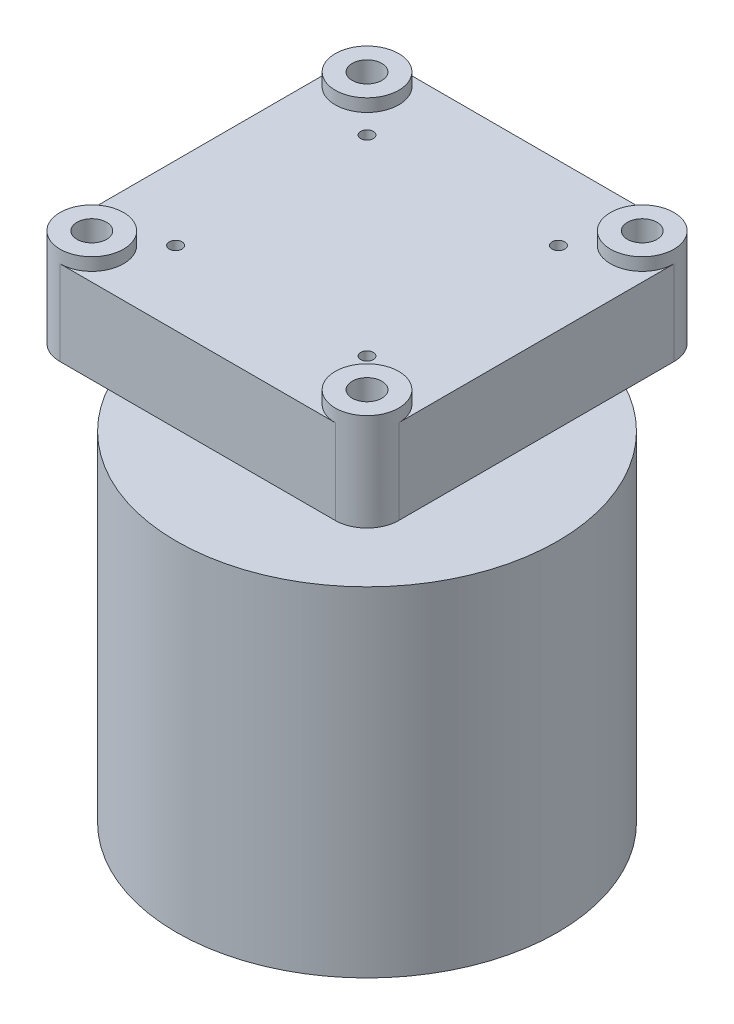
ISO-10303-21;
HEADER;
FILE_DESCRIPTION(('STEP AP214'),'2;1');
FILE_NAME('part.step','',(''),(''),'','','');
FILE_SCHEMA(('AUTOMOTIVE_DESIGN { 1 0 10303 214 1 1 1 1 }'));
ENDSEC;
DATA;
#1=APPLICATION_CONTEXT('core data for automotive mechanical design processes');
#2=APPLICATION_PROTOCOL_DEFINITION('international standard','automotive_design',2000,#1);
#3=PRODUCT_CONTEXT('',#1,'mechanical');
#4=PRODUCT('Part','Part','',(#3));
#5=PRODUCT_RELATED_PRODUCT_CATEGORY('part','',(#4));
#6=PRODUCT_DEFINITION_FORMATION('','',#4);
#7=PRODUCT_DEFINITION_CONTEXT('part definition',#1,'design');
#8=PRODUCT_DEFINITION('design','',#6,#7);
#9=PRODUCT_DEFINITION_SHAPE('','',#8);
#10=(LENGTH_UNIT() NAMED_UNIT(*) SI_UNIT(.MILLI.,.METRE.));
#11=(NAMED_UNIT(*) PLANE_ANGLE_UNIT() SI_UNIT($,.RADIAN.));
#12=(NAMED_UNIT(*) SI_UNIT($,.STERADIAN.) SOLID_ANGLE_UNIT());
#13=UNCERTAINTY_MEASURE_WITH_UNIT(LENGTH_MEASURE(1.E-05),#10,'distance_accuracy_value','');
#14=(GEOMETRIC_REPRESENTATION_CONTEXT(3) GLOBAL_UNCERTAINTY_ASSIGNED_CONTEXT((#13)) GLOBAL_UNIT_ASSIGNED_CONTEXT((#10,
#11,#12)) REPRESENTATION_CONTEXT('',''));
#15=CARTESIAN_POINT('',(0.,0.,0.));
#16=DIRECTION('',(0.,0.,1.));
#17=DIRECTION('',(1.,0.,0.));
#18=AXIS2_PLACEMENT_3D('',#15,#16,#17);
#19=CARTESIAN_POINT('',(-32.5,20.,32.5));
#20=DIRECTION('',(0.,-1.,0.));
#21=DIRECTION('',(0.,0.,-1.));
#22=AXIS2_PLACEMENT_3D('',#19,#20,#21);
#23=PLANE('',#22);
#24=CARTESIAN_POINT('',(22.6005050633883,20.,-22.6005050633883));
#25=DIRECTION('',(0.,1.,0.));
#26=DIRECTION('',(0.,0.,-1.));
#27=AXIS2_PLACEMENT_3D('',#24,#25,#26);
#28=CIRCLE('',#27,1.5);
#29=CARTESIAN_POINT('',(22.6005050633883,20.,-24.1005050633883));
#30=VERTEX_POINT('',#29);
#31=EDGE_CURVE('E169',#30,#30,#28,.T.);
#32=ORIENTED_EDGE('',*,*,#31,.F.);
#33=EDGE_LOOP('',(#32));
#34=FACE_BOUND('',#33,.T.);
#35=CARTESIAN_POINT('',(-22.6005050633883,20.,-22.6005050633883));
#36=DIRECTION('',(0.,1.,0.));
#37=DIRECTION('',(0.,0.,1.));
#38=AXIS2_PLACEMENT_3D('',#35,#36,#37);
#39=CIRCLE('',#38,1.5);
#40=CARTESIAN_POINT('',(-22.6005050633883,20.,-21.1005050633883));
#41=VERTEX_POINT('',#40);
#42=EDGE_CURVE('E175',#41,#41,#39,.T.);
#43=ORIENTED_EDGE('',*,*,#42,.F.);
#44=EDGE_LOOP('',(#43));
#45=FACE_BOUND('',#44,.T.);
#46=CARTESIAN_POINT('',(-22.6005050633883,20.,22.6005050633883));
#47=DIRECTION('',(0.,1.,0.));
#48=DIRECTION('',(0.,0.,-1.));
#49=AXIS2_PLACEMENT_3D('',#46,#47,#48);
#50=CIRCLE('',#49,1.5);
#51=CARTESIAN_POINT('',(-22.6005050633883,20.,21.1005050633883));
#52=VERTEX_POINT('',#51);
#53=EDGE_CURVE('E181',#52,#52,#50,.T.);
#54=ORIENTED_EDGE('',*,*,#53,.F.);
#55=EDGE_LOOP('',(#54));
#56=FACE_BOUND('',#55,.T.);
#57=CARTESIAN_POINT('',(22.6005050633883,20.,22.6005050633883));
#58=DIRECTION('',(0.,1.,0.));
#59=DIRECTION('',(0.,0.,1.));
#60=AXIS2_PLACEMENT_3D('',#57,#58,#59);
#61=CIRCLE('',#60,1.5);
#62=CARTESIAN_POINT('',(22.6005050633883,20.,24.1005050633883));
#63=VERTEX_POINT('',#62);
#64=EDGE_CURVE('E187',#63,#63,#61,.T.);
#65=ORIENTED_EDGE('',*,*,#64,.F.);
#66=EDGE_LOOP('',(#65));
#67=FACE_BOUND('',#66,.T.);
#68=CARTESIAN_POINT('',(-32.5,20.,-32.5));
#69=DIRECTION('',(0.,1.,0.));
#70=DIRECTION('',(0.,0.,-1.));
#71=AXIS2_PLACEMENT_3D('',#68,#69,#70);
#72=CIRCLE('',#71,7.5);
#73=CARTESIAN_POINT('',(-40.,20.,-32.5));
#74=VERTEX_POINT('',#73);
#75=CARTESIAN_POINT('',(-32.5,20.,-40.));
#76=VERTEX_POINT('',#75);
#77=EDGE_CURVE('E120',#74,#76,#72,.T.);
#78=ORIENTED_EDGE('',*,*,#77,.F.);
#79=DIRECTION('',(0.,0.,1.));
#80=VECTOR('',#79,1.);
#81=CARTESIAN_POINT('',(-40.,20.,32.5));
#82=LINE('',#81,#80);
#83=CARTESIAN_POINT('',(-40.,20.,32.5));
#84=VERTEX_POINT('',#83);
#85=EDGE_CURVE('E55',#74,#84,#82,.T.);
#86=ORIENTED_EDGE('',*,*,#85,.T.);
#87=CARTESIAN_POINT('',(-32.5,20.,32.5));
#88=DIRECTION('',(0.,1.,0.));
#89=DIRECTION('',(0.,0.,1.));
#90=AXIS2_PLACEMENT_3D('',#87,#88,#89);
#91=CIRCLE('',#90,7.5);
#92=CARTESIAN_POINT('',(-32.5,20.,40.));
#93=VERTEX_POINT('',#92);
#94=EDGE_CURVE('E136',#93,#84,#91,.T.);
#95=ORIENTED_EDGE('',*,*,#94,.F.);
#96=DIRECTION('',(1.,0.,0.));
#97=VECTOR('',#96,1.);
#98=CARTESIAN_POINT('',(-32.5,20.,40.));
#99=LINE('',#98,#97);
#100=CARTESIAN_POINT('',(32.4999999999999,20.,40.));
#101=VERTEX_POINT('',#100);
#102=EDGE_CURVE('E98',#93,#101,#99,.T.);
#103=ORIENTED_EDGE('',*,*,#102,.T.);
#104=CARTESIAN_POINT('',(32.5,20.,32.5));
#105=DIRECTION('',(0.,1.,0.));
#106=DIRECTION('',(0.,0.,-1.));
#107=AXIS2_PLACEMENT_3D('',#104,#105,#106);
#108=CIRCLE('',#107,7.5);
#109=CARTESIAN_POINT('',(40.,20.,32.5));
#110=VERTEX_POINT('',#109);
#111=EDGE_CURVE('E144',#110,#101,#108,.T.);
#112=ORIENTED_EDGE('',*,*,#111,.F.);
#113=DIRECTION('',(0.,0.,-1.));
#114=VECTOR('',#113,1.);
#115=CARTESIAN_POINT('',(40.,20.,32.5));
#116=LINE('',#115,#114);
#117=CARTESIAN_POINT('',(40.,20.,-32.5));
#118=VERTEX_POINT('',#117);
#119=EDGE_CURVE('E206',#110,#118,#116,.T.);
#120=ORIENTED_EDGE('',*,*,#119,.T.);
#121=CARTESIAN_POINT('',(32.5,20.,-32.5));
#122=DIRECTION('',(0.,1.,0.));
#123=DIRECTION('',(0.,0.,1.));
#124=AXIS2_PLACEMENT_3D('',#121,#122,#123);
#125=CIRCLE('',#124,7.5);
#126=CARTESIAN_POINT('',(32.4999999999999,20.,-40.));
#127=VERTEX_POINT('',#126);
#128=EDGE_CURVE('E11',#127,#118,#125,.T.);
#129=ORIENTED_EDGE('',*,*,#128,.F.);
#130=DIRECTION('',(-1.,0.,0.));
#131=VECTOR('',#130,1.);
#132=CARTESIAN_POINT('',(-32.5,20.,-40.));
#133=LINE('',#132,#131);
#134=EDGE_CURVE('E115',#127,#76,#133,.T.);
#135=ORIENTED_EDGE('',*,*,#134,.T.);
#136=EDGE_LOOP('',(#78,#86,#95,#103,#112,#120,#129,#135));
#137=FACE_BOUND('',#136,.T.);
#138=ADVANCED_FACE('F37',(#34,#45,#56,#67,#137),#23,.F.);
#139=CARTESIAN_POINT('',(-32.5,0.,32.5));
#140=DIRECTION('',(0.,-1.,0.));
#141=DIRECTION('',(0.,0.,-1.));
#142=AXIS2_PLACEMENT_3D('',#139,#140,#141);
#143=PLANE('',#142);
#144=CARTESIAN_POINT('',(0.,0.,0.));
#145=DIRECTION('',(0.,-1.,0.));
#146=DIRECTION('',(0.,0.,-1.));
#147=AXIS2_PLACEMENT_3D('',#144,#145,#146);
#148=CIRCLE('',#147,17.5);
#149=CARTESIAN_POINT('',(0.,0.,-17.5));
#150=VERTEX_POINT('',#149);
#151=EDGE_CURVE('E160',#150,#150,#148,.T.);
#152=ORIENTED_EDGE('',*,*,#151,.F.);
#153=EDGE_LOOP('',(#152));
#154=FACE_BOUND('',#153,.T.);
#155=CARTESIAN_POINT('',(-22.6005050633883,0.,-22.6005050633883));
#156=DIRECTION('',(0.,1.,0.));
#157=DIRECTION('',(0.,0.,1.));
#158=AXIS2_PLACEMENT_3D('',#155,#156,#157);
#159=CIRCLE('',#158,1.5);
#160=CARTESIAN_POINT('',(-22.6005050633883,0.,-21.1005050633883));
#161=VERTEX_POINT('',#160);
#162=EDGE_CURVE('E172',#161,#161,#159,.T.);
#163=ORIENTED_EDGE('',*,*,#162,.T.);
#164=EDGE_LOOP('',(#163));
#165=FACE_BOUND('',#164,.T.);
#166=CARTESIAN_POINT('',(22.6005050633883,0.,22.6005050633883));
#167=DIRECTION('',(0.,1.,0.));
#168=DIRECTION('',(0.,0.,1.));
#169=AXIS2_PLACEMENT_3D('',#166,#167,#168);
#170=CIRCLE('',#169,1.5);
#171=CARTESIAN_POINT('',(22.6005050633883,0.,24.1005050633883));
#172=VERTEX_POINT('',#171);
#173=EDGE_CURVE('E184',#172,#172,#170,.T.);
#174=ORIENTED_EDGE('',*,*,#173,.T.);
#175=EDGE_LOOP('',(#174));
#176=FACE_BOUND('',#175,.T.);
#177=CARTESIAN_POINT('',(-32.5,0.,-32.5));
#178=DIRECTION('',(0.,1.,0.));
#179=DIRECTION('',(0.,0.,-1.));
#180=AXIS2_PLACEMENT_3D('',#177,#178,#179);
#181=CIRCLE('',#180,3.5);
#182=CARTESIAN_POINT('',(-32.5,0.,-36.));
#183=VERTEX_POINT('',#182);
#184=EDGE_CURVE('E195',#183,#183,#181,.T.);
#185=ORIENTED_EDGE('',*,*,#184,.T.);
#186=EDGE_LOOP('',(#185));
#187=FACE_BOUND('',#186,.T.);
#188=CARTESIAN_POINT('',(32.5,0.,-32.5));
#189=DIRECTION('',(0.,1.,0.));
#190=DIRECTION('',(0.,0.,1.));
#191=AXIS2_PLACEMENT_3D('',#188,#189,#190);
#192=CIRCLE('',#191,3.5);
#193=CARTESIAN_POINT('',(32.5,0.,-29.));
#194=VERTEX_POINT('',#193);
#195=EDGE_CURVE('E201',#194,#194,#192,.T.);
#196=ORIENTED_EDGE('',*,*,#195,.T.);
#197=EDGE_LOOP('',(#196));
#198=FACE_BOUND('',#197,.T.);
#199=CARTESIAN_POINT('',(-32.5,0.,32.5));
#200=DIRECTION('',(0.,1.,0.));
#201=DIRECTION('',(0.,0.,-1.));
#202=AXIS2_PLACEMENT_3D('',#199,#200,#201);
#203=CIRCLE('',#202,7.5);
#204=CARTESIAN_POINT('',(-40.,0.,32.5));
#205=VERTEX_POINT('',#204);
#206=CARTESIAN_POINT('',(-32.5,0.,40.));
#207=VERTEX_POINT('',#206);
#208=EDGE_CURVE('E204',#205,#207,#203,.T.);
#209=ORIENTED_EDGE('',*,*,#208,.F.);
#210=DIRECTION('',(0.,0.,1.));
#211=VECTOR('',#210,1.);
#212=CARTESIAN_POINT('',(-40.,0.,32.5));
#213=LINE('',#212,#211);
#214=CARTESIAN_POINT('',(-40.,0.,-32.4999999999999));
#215=VERTEX_POINT('',#214);
#216=EDGE_CURVE('E92',#215,#205,#213,.T.);
#217=ORIENTED_EDGE('',*,*,#216,.F.);
#218=CARTESIAN_POINT('',(-32.5,0.,-32.5));
#219=DIRECTION('',(0.,1.,0.));
#220=DIRECTION('',(0.,0.,-1.));
#221=AXIS2_PLACEMENT_3D('',#218,#219,#220);
#222=CIRCLE('',#221,7.5);
#223=CARTESIAN_POINT('',(-32.5,0.,-40.));
#224=VERTEX_POINT('',#223);
#225=EDGE_CURVE('E86',#224,#215,#222,.T.);
#226=ORIENTED_EDGE('',*,*,#225,.F.);
#227=DIRECTION('',(-1.,0.,0.));
#228=VECTOR('',#227,1.);
#229=CARTESIAN_POINT('',(-32.5,0.,-40.));
#230=LINE('',#229,#228);
#231=CARTESIAN_POINT('',(32.4999999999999,0.,-40.));
#232=VERTEX_POINT('',#231);
#233=EDGE_CURVE('E220',#232,#224,#230,.T.);
#234=ORIENTED_EDGE('',*,*,#233,.F.);
#235=CARTESIAN_POINT('',(32.5,0.,-32.5));
#236=DIRECTION('',(0.,1.,0.));
#237=DIRECTION('',(0.,0.,-1.));
#238=AXIS2_PLACEMENT_3D('',#235,#236,#237);
#239=CIRCLE('',#238,7.5);
#240=CARTESIAN_POINT('',(40.,0.,-32.4999999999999));
#241=VERTEX_POINT('',#240);
#242=EDGE_CURVE('E218',#241,#232,#239,.T.);
#243=ORIENTED_EDGE('',*,*,#242,.F.);
#244=DIRECTION('',(0.,0.,-1.));
#245=VECTOR('',#244,1.);
#246=CARTESIAN_POINT('',(40.,0.,32.5));
#247=LINE('',#246,#245);
#248=CARTESIAN_POINT('',(40.,0.,32.5));
#249=VERTEX_POINT('',#248);
#250=EDGE_CURVE('E216',#249,#241,#247,.T.);
#251=ORIENTED_EDGE('',*,*,#250,.F.);
#252=CARTESIAN_POINT('',(32.5,0.,32.5));
#253=DIRECTION('',(0.,1.,0.));
#254=DIRECTION('',(0.,0.,1.));
#255=AXIS2_PLACEMENT_3D('',#252,#253,#254);
#256=CIRCLE('',#255,7.5);
#257=CARTESIAN_POINT('',(32.4999999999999,0.,40.));
#258=VERTEX_POINT('',#257);
#259=EDGE_CURVE('E214',#258,#249,#256,.T.);
#260=ORIENTED_EDGE('',*,*,#259,.F.);
#261=DIRECTION('',(1.,0.,0.));
#262=VECTOR('',#261,1.);
#263=CARTESIAN_POINT('',(-32.5,0.,40.));
#264=LINE('',#263,#262);
#265=EDGE_CURVE('E212',#207,#258,#264,.T.);
#266=ORIENTED_EDGE('',*,*,#265,.F.);
#267=EDGE_LOOP('',(#209,#217,#226,#234,#243,#251,#260,#266));
#268=FACE_BOUND('',#267,.T.);
#269=CARTESIAN_POINT('',(-32.5,0.,32.5));
#270=DIRECTION('',(0.,1.,0.));
#271=DIRECTION('',(0.,0.,-1.));
#272=AXIS2_PLACEMENT_3D('',#269,#270,#271);
#273=CIRCLE('',#272,3.49999999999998);
#274=CARTESIAN_POINT('',(-32.5,0.,29.0000000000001));
#275=VERTEX_POINT('',#274);
#276=EDGE_CURVE('E198',#275,#275,#273,.T.);
#277=ORIENTED_EDGE('',*,*,#276,.T.);
#278=EDGE_LOOP('',(#277));
#279=FACE_BOUND('',#278,.T.);
#280=CARTESIAN_POINT('',(32.5,0.,32.5));
#281=DIRECTION('',(0.,1.,0.));
#282=DIRECTION('',(0.,0.,1.));
#283=AXIS2_PLACEMENT_3D('',#280,#281,#282);
#284=CIRCLE('',#283,3.50000000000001);
#285=CARTESIAN_POINT('',(32.5,0.,36.));
#286=VERTEX_POINT('',#285);
#287=EDGE_CURVE('E190',#286,#286,#284,.T.);
#288=ORIENTED_EDGE('',*,*,#287,.T.);
#289=EDGE_LOOP('',(#288));
#290=FACE_BOUND('',#289,.T.);
#291=CARTESIAN_POINT('',(-22.6005050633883,0.,22.6005050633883));
#292=DIRECTION('',(0.,1.,0.));
#293=DIRECTION('',(0.,0.,-1.));
#294=AXIS2_PLACEMENT_3D('',#291,#292,#293);
#295=CIRCLE('',#294,1.5);
#296=CARTESIAN_POINT('',(-22.6005050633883,0.,21.1005050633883));
#297=VERTEX_POINT('',#296);
#298=EDGE_CURVE('E178',#297,#297,#295,.T.);
#299=ORIENTED_EDGE('',*,*,#298,.T.);
#300=EDGE_LOOP('',(#299));
#301=FACE_BOUND('',#300,.T.);
#302=CARTESIAN_POINT('',(22.6005050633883,0.,-22.6005050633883));
#303=DIRECTION('',(0.,1.,0.));
#304=DIRECTION('',(0.,0.,-1.));
#305=AXIS2_PLACEMENT_3D('',#302,#303,#304);
#306=CIRCLE('',#305,1.5);
#307=CARTESIAN_POINT('',(22.6005050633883,0.,-24.1005050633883));
#308=VERTEX_POINT('',#307);
#309=EDGE_CURVE('E166',#308,#308,#306,.T.);
#310=ORIENTED_EDGE('',*,*,#309,.T.);
#311=EDGE_LOOP('',(#310));
#312=FACE_BOUND('',#311,.T.);
#313=ADVANCED_FACE('F245',(#154,#165,#176,#187,#198,#268,#279,#290,#301,#312),#143,.T.);
#314=CARTESIAN_POINT('',(-32.5,20.,32.5));
#315=DIRECTION('',(0.,-1.,0.));
#316=DIRECTION('',(0.,0.,-1.));
#317=AXIS2_PLACEMENT_3D('',#314,#315,#316);
#318=CYLINDRICAL_SURFACE('',#317,7.5);
#319=ORIENTED_EDGE('',*,*,#208,.T.);
#320=DIRECTION('',(0.,-1.,0.));
#321=VECTOR('',#320,1.);
#322=CARTESIAN_POINT('',(-32.5,20.,40.));
#323=LINE('',#322,#321);
#324=EDGE_CURVE('E41',#93,#207,#323,.T.);
#325=ORIENTED_EDGE('',*,*,#324,.F.);
#326=ORIENTED_EDGE('',*,*,#94,.T.);
#327=DIRECTION('',(0.,-1.,0.));
#328=VECTOR('',#327,1.);
#329=CARTESIAN_POINT('',(-40.,20.,32.5));
#330=LINE('',#329,#328);
#331=EDGE_CURVE('E113',#84,#205,#330,.T.);
#332=ORIENTED_EDGE('',*,*,#331,.T.);
#333=EDGE_LOOP('',(#319,#325,#326,#332));
#334=FACE_BOUND('',#333,.T.);
#335=CARTESIAN_POINT('',(-32.5,23.,32.5));
#336=DIRECTION('',(0.,1.,0.));
#337=DIRECTION('',(0.,0.,1.));
#338=AXIS2_PLACEMENT_3D('',#335,#336,#337);
#339=CIRCLE('',#338,7.5);
#340=CARTESIAN_POINT('',(-32.5,23.,40.));
#341=VERTEX_POINT('',#340);
#342=EDGE_CURVE('E137',#341,#341,#339,.T.);
#343=ORIENTED_EDGE('',*,*,#342,.F.);
#344=EDGE_LOOP('',(#343));
#345=FACE_BOUND('',#344,.T.);
#346=ADVANCED_FACE('F39',(#334,#345),#318,.T.);
#347=CARTESIAN_POINT('',(-32.5,20.,40.));
#348=DIRECTION('',(0.,0.,-1.));
#349=DIRECTION('',(-1.,0.,0.));
#350=AXIS2_PLACEMENT_3D('',#347,#348,#349);
#351=PLANE('',#350);
#352=ORIENTED_EDGE('',*,*,#265,.T.);
#353=DIRECTION('',(0.,-1.,0.));
#354=VECTOR('',#353,1.);
#355=CARTESIAN_POINT('',(32.4999999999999,20.,40.));
#356=LINE('',#355,#354);
#357=EDGE_CURVE('E234',#101,#258,#356,.T.);
#358=ORIENTED_EDGE('',*,*,#357,.F.);
#359=ORIENTED_EDGE('',*,*,#102,.F.);
#360=ORIENTED_EDGE('',*,*,#324,.T.);
#361=EDGE_LOOP('',(#352,#358,#359,#360));
#362=FACE_BOUND('',#361,.T.);
#363=ADVANCED_FACE('F240',(#362),#351,.F.);
#364=CARTESIAN_POINT('',(32.5,20.,32.5));
#365=DIRECTION('',(0.,-1.,0.));
#366=DIRECTION('',(0.,0.,-1.));
#367=AXIS2_PLACEMENT_3D('',#364,#365,#366);
#368=CYLINDRICAL_SURFACE('',#367,7.5);
#369=ORIENTED_EDGE('',*,*,#259,.T.);
#370=DIRECTION('',(0.,-1.,0.));
#371=VECTOR('',#370,1.);
#372=CARTESIAN_POINT('',(40.,20.,32.5));
#373=LINE('',#372,#371);
#374=EDGE_CURVE('E232',#110,#249,#373,.T.);
#375=ORIENTED_EDGE('',*,*,#374,.F.);
#376=ORIENTED_EDGE('',*,*,#111,.T.);
#377=ORIENTED_EDGE('',*,*,#357,.T.);
#378=EDGE_LOOP('',(#369,#375,#376,#377));
#379=FACE_BOUND('',#378,.T.);
#380=CARTESIAN_POINT('',(32.5,23.,32.5));
#381=DIRECTION('',(0.,1.,0.));
#382=DIRECTION('',(0.,0.,-1.));
#383=AXIS2_PLACEMENT_3D('',#380,#381,#382);
#384=CIRCLE('',#383,7.5);
#385=CARTESIAN_POINT('',(32.5,23.,25.));
#386=VERTEX_POINT('',#385);
#387=EDGE_CURVE('E145',#386,#386,#384,.T.);
#388=ORIENTED_EDGE('',*,*,#387,.F.);
#389=EDGE_LOOP('',(#388));
#390=FACE_BOUND('',#389,.T.);
#391=ADVANCED_FACE('F250',(#379,#390),#368,.T.);
#392=CARTESIAN_POINT('',(40.,20.,32.5));
#393=DIRECTION('',(-1.,0.,0.));
#394=DIRECTION('',(0.,0.,1.));
#395=AXIS2_PLACEMENT_3D('',#392,#393,#394);
#396=PLANE('',#395);
#397=ORIENTED_EDGE('',*,*,#250,.T.);
#398=DIRECTION('',(0.,-1.,0.));
#399=VECTOR('',#398,1.);
#400=CARTESIAN_POINT('',(40.,20.,-32.4999999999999));
#401=LINE('',#400,#399);
#402=EDGE_CURVE('E229',#118,#241,#401,.T.);
#403=ORIENTED_EDGE('',*,*,#402,.F.);
#404=ORIENTED_EDGE('',*,*,#119,.F.);
#405=ORIENTED_EDGE('',*,*,#374,.T.);
#406=EDGE_LOOP('',(#397,#403,#404,#405));
#407=FACE_BOUND('',#406,.T.);
#408=ADVANCED_FACE('F253',(#407),#396,.F.);
#409=CARTESIAN_POINT('',(32.5,20.,-32.5));
#410=DIRECTION('',(0.,-1.,0.));
#411=DIRECTION('',(0.,0.,-1.));
#412=AXIS2_PLACEMENT_3D('',#409,#410,#411);
#413=CYLINDRICAL_SURFACE('',#412,7.5);
#414=ORIENTED_EDGE('',*,*,#242,.T.);
#415=DIRECTION('',(0.,-1.,0.));
#416=VECTOR('',#415,1.);
#417=CARTESIAN_POINT('',(32.4999999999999,20.,-40.));
#418=LINE('',#417,#416);
#419=EDGE_CURVE('E226',#127,#232,#418,.T.);
#420=ORIENTED_EDGE('',*,*,#419,.F.);
#421=ORIENTED_EDGE('',*,*,#128,.T.);
#422=ORIENTED_EDGE('',*,*,#402,.T.);
#423=EDGE_LOOP('',(#414,#420,#421,#422));
#424=FACE_BOUND('',#423,.T.);
#425=CARTESIAN_POINT('',(32.5,23.,-32.5));
#426=DIRECTION('',(0.,1.,0.));
#427=DIRECTION('',(0.,0.,1.));
#428=AXIS2_PLACEMENT_3D('',#425,#426,#427);
#429=CIRCLE('',#428,7.5);
#430=CARTESIAN_POINT('',(32.5,23.,-25.));
#431=VERTEX_POINT('',#430);
#432=EDGE_CURVE('E153',#431,#431,#429,.T.);
#433=ORIENTED_EDGE('',*,*,#432,.F.);
#434=EDGE_LOOP('',(#433));
#435=FACE_BOUND('',#434,.T.);
#436=ADVANCED_FACE('F256',(#424,#435),#413,.T.);
#437=CARTESIAN_POINT('',(-32.5,20.,-40.));
#438=DIRECTION('',(0.,0.,1.));
#439=DIRECTION('',(1.,0.,0.));
#440=AXIS2_PLACEMENT_3D('',#437,#438,#439);
#441=PLANE('',#440);
#442=ORIENTED_EDGE('',*,*,#233,.T.);
#443=DIRECTION('',(0.,-1.,0.));
#444=VECTOR('',#443,1.);
#445=CARTESIAN_POINT('',(-32.5,20.,-40.));
#446=LINE('',#445,#444);
#447=EDGE_CURVE('E121',#76,#224,#446,.T.);
#448=ORIENTED_EDGE('',*,*,#447,.F.);
#449=ORIENTED_EDGE('',*,*,#134,.F.);
#450=ORIENTED_EDGE('',*,*,#419,.T.);
#451=EDGE_LOOP('',(#442,#448,#449,#450));
#452=FACE_BOUND('',#451,.T.);
#453=ADVANCED_FACE('F260',(#452),#441,.F.);
#454=CARTESIAN_POINT('',(-32.5,20.,-32.5));
#455=DIRECTION('',(0.,-1.,0.));
#456=DIRECTION('',(0.,0.,-1.));
#457=AXIS2_PLACEMENT_3D('',#454,#455,#456);
#458=CYLINDRICAL_SURFACE('',#457,7.5);
#459=ORIENTED_EDGE('',*,*,#225,.T.);
#460=DIRECTION('',(0.,-1.,0.));
#461=VECTOR('',#460,1.);
#462=CARTESIAN_POINT('',(-40.,20.,-32.4999999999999));
#463=LINE('',#462,#461);
#464=EDGE_CURVE('E112',#74,#215,#463,.T.);
#465=ORIENTED_EDGE('',*,*,#464,.F.);
#466=ORIENTED_EDGE('',*,*,#77,.T.);
#467=ORIENTED_EDGE('',*,*,#447,.T.);
#468=EDGE_LOOP('',(#459,#465,#466,#467));
#469=FACE_BOUND('',#468,.T.);
#470=CARTESIAN_POINT('',(-32.5,23.,-32.5));
#471=DIRECTION('',(0.,1.,0.));
#472=DIRECTION('',(0.,0.,-1.));
#473=AXIS2_PLACEMENT_3D('',#470,#471,#472);
#474=CIRCLE('',#473,7.5);
#475=CARTESIAN_POINT('',(-32.5,23.,-40.));
#476=VERTEX_POINT('',#475);
#477=EDGE_CURVE('E125',#476,#476,#474,.T.);
#478=ORIENTED_EDGE('',*,*,#477,.F.);
#479=EDGE_LOOP('',(#478));
#480=FACE_BOUND('',#479,.T.);
#481=ADVANCED_FACE('F118',(#469,#480),#458,.T.);
#482=CARTESIAN_POINT('',(-40.,20.,32.5));
#483=DIRECTION('',(1.,0.,0.));
#484=DIRECTION('',(0.,0.,-1.));
#485=AXIS2_PLACEMENT_3D('',#482,#483,#484);
#486=PLANE('',#485);
#487=ORIENTED_EDGE('',*,*,#216,.T.);
#488=ORIENTED_EDGE('',*,*,#331,.F.);
#489=ORIENTED_EDGE('',*,*,#85,.F.);
#490=ORIENTED_EDGE('',*,*,#464,.T.);
#491=EDGE_LOOP('',(#487,#488,#489,#490));
#492=FACE_BOUND('',#491,.T.);
#493=ADVANCED_FACE('F111',(#492),#486,.F.);
#494=CARTESIAN_POINT('',(32.5,20.,-32.5));
#495=DIRECTION('',(0.,-1.,0.));
#496=DIRECTION('',(0.,0.,-1.));
#497=AXIS2_PLACEMENT_3D('',#494,#495,#496);
#498=CYLINDRICAL_SURFACE('',#497,3.5);
#499=ORIENTED_EDGE('',*,*,#195,.F.);
#500=EDGE_LOOP('',(#499));
#501=FACE_BOUND('',#500,.T.);
#502=CARTESIAN_POINT('',(32.5,23.,-32.5));
#503=DIRECTION('',(0.,1.,0.));
#504=DIRECTION('',(0.,0.,1.));
#505=AXIS2_PLACEMENT_3D('',#502,#503,#504);
#506=CIRCLE('',#505,3.50000000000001);
#507=CARTESIAN_POINT('',(32.5,23.,-29.));
#508=VERTEX_POINT('',#507);
#509=EDGE_CURVE('E148',#508,#508,#506,.T.);
#510=ORIENTED_EDGE('',*,*,#509,.T.);
#511=EDGE_LOOP('',(#510));
#512=FACE_BOUND('',#511,.T.);
#513=ADVANCED_FACE('F280',(#501,#512),#498,.F.);
#514=CARTESIAN_POINT('',(-32.5,20.,32.5));
#515=DIRECTION('',(0.,-1.,0.));
#516=DIRECTION('',(0.,0.,-1.));
#517=AXIS2_PLACEMENT_3D('',#514,#515,#516);
#518=CYLINDRICAL_SURFACE('',#517,3.49999999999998);
#519=ORIENTED_EDGE('',*,*,#276,.F.);
#520=EDGE_LOOP('',(#519));
#521=FACE_BOUND('',#520,.T.);
#522=CARTESIAN_POINT('',(-32.5,23.,32.5));
#523=DIRECTION('',(0.,1.,0.));
#524=DIRECTION('',(0.,0.,1.));
#525=AXIS2_PLACEMENT_3D('',#522,#523,#524);
#526=CIRCLE('',#525,3.50000000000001);
#527=CARTESIAN_POINT('',(-32.5,23.,36.));
#528=VERTEX_POINT('',#527);
#529=EDGE_CURVE('E129',#528,#528,#526,.T.);
#530=ORIENTED_EDGE('',*,*,#529,.T.);
#531=EDGE_LOOP('',(#530));
#532=FACE_BOUND('',#531,.T.);
#533=ADVANCED_FACE('F287',(#521,#532),#518,.F.);
#534=CARTESIAN_POINT('',(-32.5,20.,-32.5));
#535=DIRECTION('',(0.,-1.,0.));
#536=DIRECTION('',(0.,0.,-1.));
#537=AXIS2_PLACEMENT_3D('',#534,#535,#536);
#538=CYLINDRICAL_SURFACE('',#537,3.5);
#539=ORIENTED_EDGE('',*,*,#184,.F.);
#540=EDGE_LOOP('',(#539));
#541=FACE_BOUND('',#540,.T.);
#542=CARTESIAN_POINT('',(-32.5,23.,-32.5));
#543=DIRECTION('',(0.,1.,0.));
#544=DIRECTION('',(0.,0.,-1.));
#545=AXIS2_PLACEMENT_3D('',#542,#543,#544);
#546=CIRCLE('',#545,3.50000000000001);
#547=CARTESIAN_POINT('',(-32.5,23.,-36.));
#548=VERTEX_POINT('',#547);
#549=EDGE_CURVE('E126',#548,#548,#546,.T.);
#550=ORIENTED_EDGE('',*,*,#549,.T.);
#551=EDGE_LOOP('',(#550));
#552=FACE_BOUND('',#551,.T.);
#553=ADVANCED_FACE('F292',(#541,#552),#538,.F.);
#554=CARTESIAN_POINT('',(32.5,20.,32.5));
#555=DIRECTION('',(0.,-1.,0.));
#556=DIRECTION('',(0.,0.,-1.));
#557=AXIS2_PLACEMENT_3D('',#554,#555,#556);
#558=CYLINDRICAL_SURFACE('',#557,3.50000000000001);
#559=ORIENTED_EDGE('',*,*,#287,.F.);
#560=EDGE_LOOP('',(#559));
#561=FACE_BOUND('',#560,.T.);
#562=CARTESIAN_POINT('',(32.5,23.,32.5));
#563=DIRECTION('',(0.,1.,0.));
#564=DIRECTION('',(0.,0.,-1.));
#565=AXIS2_PLACEMENT_3D('',#562,#563,#564);
#566=CIRCLE('',#565,3.50000000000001);
#567=CARTESIAN_POINT('',(32.5,23.,29.));
#568=VERTEX_POINT('',#567);
#569=EDGE_CURVE('E140',#568,#568,#566,.T.);
#570=ORIENTED_EDGE('',*,*,#569,.T.);
#571=EDGE_LOOP('',(#570));
#572=FACE_BOUND('',#571,.T.);
#573=ADVANCED_FACE('F342',(#561,#572),#558,.F.);
#574=CARTESIAN_POINT('',(22.6005050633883,20.,22.6005050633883));
#575=DIRECTION('',(0.,-1.,0.));
#576=DIRECTION('',(0.,0.,-1.));
#577=AXIS2_PLACEMENT_3D('',#574,#575,#576);
#578=CYLINDRICAL_SURFACE('',#577,1.5);
#579=ORIENTED_EDGE('',*,*,#64,.T.);
#580=EDGE_LOOP('',(#579));
#581=FACE_BOUND('',#580,.T.);
#582=ORIENTED_EDGE('',*,*,#173,.F.);
#583=EDGE_LOOP('',(#582));
#584=FACE_BOUND('',#583,.T.);
#585=ADVANCED_FACE('F338',(#581,#584),#578,.F.);
#586=CARTESIAN_POINT('',(-22.6005050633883,20.,22.6005050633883));
#587=DIRECTION('',(0.,-1.,0.));
#588=DIRECTION('',(0.,0.,-1.));
#589=AXIS2_PLACEMENT_3D('',#586,#587,#588);
#590=CYLINDRICAL_SURFACE('',#589,1.5);
#591=ORIENTED_EDGE('',*,*,#53,.T.);
#592=EDGE_LOOP('',(#591));
#593=FACE_BOUND('',#592,.T.);
#594=ORIENTED_EDGE('',*,*,#298,.F.);
#595=EDGE_LOOP('',(#594));
#596=FACE_BOUND('',#595,.T.);
#597=ADVANCED_FACE('F334',(#593,#596),#590,.F.);
#598=CARTESIAN_POINT('',(-22.6005050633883,20.,-22.6005050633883));
#599=DIRECTION('',(0.,-1.,0.));
#600=DIRECTION('',(0.,0.,-1.));
#601=AXIS2_PLACEMENT_3D('',#598,#599,#600);
#602=CYLINDRICAL_SURFACE('',#601,1.5);
#603=ORIENTED_EDGE('',*,*,#42,.T.);
#604=EDGE_LOOP('',(#603));
#605=FACE_BOUND('',#604,.T.);
#606=ORIENTED_EDGE('',*,*,#162,.F.);
#607=EDGE_LOOP('',(#606));
#608=FACE_BOUND('',#607,.T.);
#609=ADVANCED_FACE('F330',(#605,#608),#602,.F.);
#610=CARTESIAN_POINT('',(22.6005050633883,20.,-22.6005050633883));
#611=DIRECTION('',(0.,-1.,0.));
#612=DIRECTION('',(0.,0.,-1.));
#613=AXIS2_PLACEMENT_3D('',#610,#611,#612);
#614=CYLINDRICAL_SURFACE('',#613,1.5);
#615=ORIENTED_EDGE('',*,*,#31,.T.);
#616=EDGE_LOOP('',(#615));
#617=FACE_BOUND('',#616,.T.);
#618=ORIENTED_EDGE('',*,*,#309,.F.);
#619=EDGE_LOOP('',(#618));
#620=FACE_BOUND('',#619,.T.);
#621=ADVANCED_FACE('F326',(#617,#620),#614,.F.);
#622=CARTESIAN_POINT('',(0.,-18.,0.));
#623=DIRECTION('',(0.,1.,0.));
#624=DIRECTION('',(0.,0.,1.));
#625=AXIS2_PLACEMENT_3D('',#622,#623,#624);
#626=CYLINDRICAL_SURFACE('',#625,17.5);
#627=CARTESIAN_POINT('',(0.,-18.,0.));
#628=DIRECTION('',(0.,-1.,0.));
#629=DIRECTION('',(0.,0.,-1.));
#630=AXIS2_PLACEMENT_3D('',#627,#628,#629);
#631=CIRCLE('',#630,17.5);
#632=CARTESIAN_POINT('',(0.,-18.,-17.5));
#633=VERTEX_POINT('',#632);
#634=EDGE_CURVE('E163',#633,#633,#631,.T.);
#635=ORIENTED_EDGE('',*,*,#634,.F.);
#636=EDGE_LOOP('',(#635));
#637=FACE_BOUND('',#636,.T.);
#638=ORIENTED_EDGE('',*,*,#151,.T.);
#639=EDGE_LOOP('',(#638));
#640=FACE_BOUND('',#639,.T.);
#641=ADVANCED_FACE('F322',(#637,#640),#626,.T.);
#642=CARTESIAN_POINT('',(0.,-98.,0.));
#643=DIRECTION('',(0.,1.,0.));
#644=DIRECTION('',(0.,0.,1.));
#645=AXIS2_PLACEMENT_3D('',#642,#643,#644);
#646=CYLINDRICAL_SURFACE('',#645,45.);
#647=CARTESIAN_POINT('',(0.,-98.,0.));
#648=DIRECTION('',(0.,-1.,0.));
#649=DIRECTION('',(0.,0.,-1.));
#650=AXIS2_PLACEMENT_3D('',#647,#648,#649);
#651=CIRCLE('',#650,45.);
#652=CARTESIAN_POINT('',(0.,-98.,-45.));
#653=VERTEX_POINT('',#652);
#654=EDGE_CURVE('E157',#653,#653,#651,.T.);
#655=ORIENTED_EDGE('',*,*,#654,.F.);
#656=EDGE_LOOP('',(#655));
#657=FACE_BOUND('',#656,.T.);
#658=CARTESIAN_POINT('',(0.,-18.,0.));
#659=DIRECTION('',(0.,-1.,0.));
#660=DIRECTION('',(0.,0.,-1.));
#661=AXIS2_PLACEMENT_3D('',#658,#659,#660);
#662=CIRCLE('',#661,45.);
#663=CARTESIAN_POINT('',(0.,-18.,-45.));
#664=VERTEX_POINT('',#663);
#665=EDGE_CURVE('E155',#664,#664,#662,.T.);
#666=ORIENTED_EDGE('',*,*,#665,.T.);
#667=EDGE_LOOP('',(#666));
#668=FACE_BOUND('',#667,.T.);
#669=ADVANCED_FACE('F317',(#657,#668),#646,.T.);
#670=CARTESIAN_POINT('',(0.,-98.,0.));
#671=DIRECTION('',(0.,-1.,0.));
#672=DIRECTION('',(0.,0.,-1.));
#673=AXIS2_PLACEMENT_3D('',#670,#671,#672);
#674=PLANE('',#673);
#675=ORIENTED_EDGE('',*,*,#654,.T.);
#676=EDGE_LOOP('',(#675));
#677=FACE_BOUND('',#676,.T.);
#678=ADVANCED_FACE('F311',(#677),#674,.T.);
#679=CARTESIAN_POINT('',(0.,-18.,0.));
#680=DIRECTION('',(0.,-1.,0.));
#681=DIRECTION('',(0.,0.,-1.));
#682=AXIS2_PLACEMENT_3D('',#679,#680,#681);
#683=PLANE('',#682);
#684=ORIENTED_EDGE('',*,*,#634,.T.);
#685=EDGE_LOOP('',(#684));
#686=FACE_BOUND('',#685,.T.);
#687=ORIENTED_EDGE('',*,*,#665,.F.);
#688=EDGE_LOOP('',(#687));
#689=FACE_BOUND('',#688,.T.);
#690=ADVANCED_FACE('F301',(#686,#689),#683,.F.);
#691=CARTESIAN_POINT('',(32.5,23.,-32.5));
#692=DIRECTION('',(0.,1.,0.));
#693=DIRECTION('',(0.,0.,1.));
#694=AXIS2_PLACEMENT_3D('',#691,#692,#693);
#695=PLANE('',#694);
#696=ORIENTED_EDGE('',*,*,#432,.T.);
#697=EDGE_LOOP('',(#696));
#698=FACE_BOUND('',#697,.T.);
#699=ORIENTED_EDGE('',*,*,#509,.F.);
#700=EDGE_LOOP('',(#699));
#701=FACE_BOUND('',#700,.T.);
#702=ADVANCED_FACE('F298',(#698,#701),#695,.T.);
#703=CARTESIAN_POINT('',(32.5,23.,32.5));
#704=DIRECTION('',(0.,-1.,0.));
#705=DIRECTION('',(0.,0.,-1.));
#706=AXIS2_PLACEMENT_3D('',#703,#704,#705);
#707=PLANE('',#706);
#708=ORIENTED_EDGE('',*,*,#387,.T.);
#709=EDGE_LOOP('',(#708));
#710=FACE_BOUND('',#709,.T.);
#711=ORIENTED_EDGE('',*,*,#569,.F.);
#712=EDGE_LOOP('',(#711));
#713=FACE_BOUND('',#712,.T.);
#714=ADVANCED_FACE('F300',(#710,#713),#707,.F.);
#715=CARTESIAN_POINT('',(-32.5,23.,32.5));
#716=DIRECTION('',(0.,1.,0.));
#717=DIRECTION('',(0.,0.,1.));
#718=AXIS2_PLACEMENT_3D('',#715,#716,#717);
#719=PLANE('',#718);
#720=ORIENTED_EDGE('',*,*,#342,.T.);
#721=EDGE_LOOP('',(#720));
#722=FACE_BOUND('',#721,.T.);
#723=ORIENTED_EDGE('',*,*,#529,.F.);
#724=EDGE_LOOP('',(#723));
#725=FACE_BOUND('',#724,.T.);
#726=ADVANCED_FACE('F308',(#722,#725),#719,.T.);
#727=CARTESIAN_POINT('',(-32.5,23.,-32.5));
#728=DIRECTION('',(0.,-1.,0.));
#729=DIRECTION('',(0.,0.,-1.));
#730=AXIS2_PLACEMENT_3D('',#727,#728,#729);
#731=PLANE('',#730);
#732=ORIENTED_EDGE('',*,*,#477,.T.);
#733=EDGE_LOOP('',(#732));
#734=FACE_BOUND('',#733,.T.);
#735=ORIENTED_EDGE('',*,*,#549,.F.);
#736=EDGE_LOOP('',(#735));
#737=FACE_BOUND('',#736,.T.);
#738=ADVANCED_FACE('F355',(#734,#737),#731,.F.);
#739=CLOSED_SHELL('',(#138,#313,#346,#363,#391,#408,#436,#453,#481,#493,#513,#533,#553,#573,
#585,#597,#609,#621,#641,#669,#678,#690,#702,#714,#726,#738));
#740=MANIFOLD_SOLID_BREP('B2',#739);
#741=ADVANCED_BREP_SHAPE_REPRESENTATION('',(#18,#740),#14);
#742=SHAPE_DEFINITION_REPRESENTATION(#9,#741);
ENDSEC;
END-ISO-10303-21;
